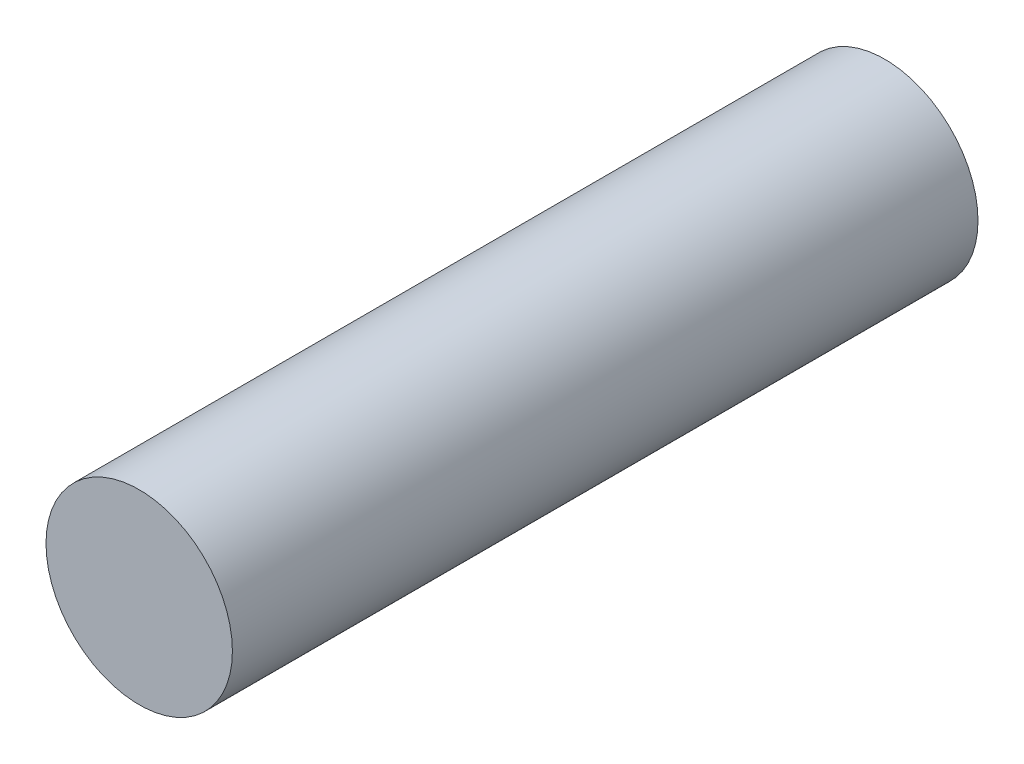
ISO-10303-21;
HEADER;
FILE_DESCRIPTION(('STEP AP214'),'2;1');
FILE_NAME('part.step','',(''),(''),'','','');
FILE_SCHEMA(('AUTOMOTIVE_DESIGN { 1 0 10303 214 1 1 1 1 }'));
ENDSEC;
DATA;
#1=APPLICATION_CONTEXT('core data for automotive mechanical design processes');
#2=APPLICATION_PROTOCOL_DEFINITION('international standard','automotive_design',2000,#1);
#3=PRODUCT_CONTEXT('',#1,'mechanical');
#4=PRODUCT('Part','Part','',(#3));
#5=PRODUCT_RELATED_PRODUCT_CATEGORY('part','',(#4));
#6=PRODUCT_DEFINITION_FORMATION('','',#4);
#7=PRODUCT_DEFINITION_CONTEXT('part definition',#1,'design');
#8=PRODUCT_DEFINITION('design','',#6,#7);
#9=PRODUCT_DEFINITION_SHAPE('','',#8);
#10=(LENGTH_UNIT() NAMED_UNIT(*) SI_UNIT(.MILLI.,.METRE.));
#11=(NAMED_UNIT(*) PLANE_ANGLE_UNIT() SI_UNIT($,.RADIAN.));
#12=(NAMED_UNIT(*) SI_UNIT($,.STERADIAN.) SOLID_ANGLE_UNIT());
#13=UNCERTAINTY_MEASURE_WITH_UNIT(LENGTH_MEASURE(1.E-05),#10,'distance_accuracy_value','');
#14=(GEOMETRIC_REPRESENTATION_CONTEXT(3) GLOBAL_UNCERTAINTY_ASSIGNED_CONTEXT((#13)) GLOBAL_UNIT_ASSIGNED_CONTEXT((#10,
#11,#12)) REPRESENTATION_CONTEXT('',''));
#15=CARTESIAN_POINT('',(0.,0.,0.));
#16=DIRECTION('',(0.,0.,1.));
#17=DIRECTION('',(1.,0.,0.));
#18=AXIS2_PLACEMENT_3D('',#15,#16,#17);
#19=CARTESIAN_POINT('',(0.,0.,76.2));
#20=DIRECTION('',(0.,0.,-1.));
#21=DIRECTION('',(-1.,0.,0.));
#22=AXIS2_PLACEMENT_3D('',#19,#20,#21);
#23=CYLINDRICAL_SURFACE('',#22,9.525);
#24=CARTESIAN_POINT('',(0.,0.,76.2));
#25=DIRECTION('',(0.,0.,1.));
#26=DIRECTION('',(1.,0.,0.));
#27=AXIS2_PLACEMENT_3D('',#24,#25,#26);
#28=CIRCLE('',#27,9.525);
#29=CARTESIAN_POINT('',(-9.525,0.,76.2));
#30=VERTEX_POINT('',#29);
#31=EDGE_CURVE('E10',#30,#30,#28,.T.);
#32=CARTESIAN_POINT('',(0.,0.,0.));
#33=DIRECTION('',(0.,0.,1.));
#34=DIRECTION('',(1.,0.,0.));
#35=AXIS2_PLACEMENT_3D('',#32,#33,#34);
#36=CIRCLE('',#35,9.525);
#37=CARTESIAN_POINT('',(-9.525,0.,0.));
#38=VERTEX_POINT('',#37);
#39=EDGE_CURVE('E40',#38,#38,#36,.T.);
#40=CARTESIAN_POINT('',(-9.525,0.,76.2));
#41=CARTESIAN_POINT('',(-9.525,0.,75.40625));
#42=CARTESIAN_POINT('',(-9.525,0.,74.6125));
#43=CARTESIAN_POINT('',(-9.525,0.,73.025));
#44=CARTESIAN_POINT('',(-9.525,0.,72.23125));
#45=CARTESIAN_POINT('',(-9.525,0.,70.64375));
#46=CARTESIAN_POINT('',(-9.525,0.,69.85));
#47=CARTESIAN_POINT('',(-9.525,0.,68.2625));
#48=CARTESIAN_POINT('',(-9.525,0.,67.46875));
#49=CARTESIAN_POINT('',(-9.525,0.,65.88125));
#50=CARTESIAN_POINT('',(-9.525,0.,65.0875));
#51=CARTESIAN_POINT('',(-9.525,0.,63.5));
#52=CARTESIAN_POINT('',(-9.525,0.,62.70625));
#53=CARTESIAN_POINT('',(-9.525,0.,61.11875));
#54=CARTESIAN_POINT('',(-9.525,0.,60.325));
#55=CARTESIAN_POINT('',(-9.525,0.,58.7375));
#56=CARTESIAN_POINT('',(-9.525,0.,57.94375));
#57=CARTESIAN_POINT('',(-9.525,0.,56.35625));
#58=CARTESIAN_POINT('',(-9.525,0.,55.5625));
#59=CARTESIAN_POINT('',(-9.525,0.,53.975));
#60=CARTESIAN_POINT('',(-9.525,0.,53.18125));
#61=CARTESIAN_POINT('',(-9.525,0.,51.59375));
#62=CARTESIAN_POINT('',(-9.525,0.,50.8));
#63=CARTESIAN_POINT('',(-9.525,0.,49.2125));
#64=CARTESIAN_POINT('',(-9.525,0.,48.41875));
#65=CARTESIAN_POINT('',(-9.525,0.,46.83125));
#66=CARTESIAN_POINT('',(-9.525,0.,46.0375));
#67=CARTESIAN_POINT('',(-9.525,0.,44.45));
#68=CARTESIAN_POINT('',(-9.525,0.,43.65625));
#69=CARTESIAN_POINT('',(-9.525,0.,42.06875));
#70=CARTESIAN_POINT('',(-9.525,0.,41.275));
#71=CARTESIAN_POINT('',(-9.525,0.,39.6875));
#72=CARTESIAN_POINT('',(-9.525,0.,38.89375));
#73=CARTESIAN_POINT('',(-9.525,0.,37.30625));
#74=CARTESIAN_POINT('',(-9.525,0.,36.5125));
#75=CARTESIAN_POINT('',(-9.525,0.,34.925));
#76=CARTESIAN_POINT('',(-9.525,0.,34.13125));
#77=CARTESIAN_POINT('',(-9.525,0.,32.54375));
#78=CARTESIAN_POINT('',(-9.525,0.,31.75));
#79=CARTESIAN_POINT('',(-9.525,0.,30.1625));
#80=CARTESIAN_POINT('',(-9.525,0.,29.36875));
#81=CARTESIAN_POINT('',(-9.525,0.,27.78125));
#82=CARTESIAN_POINT('',(-9.525,0.,26.9875));
#83=CARTESIAN_POINT('',(-9.525,0.,25.4));
#84=CARTESIAN_POINT('',(-9.525,0.,24.60625));
#85=CARTESIAN_POINT('',(-9.525,0.,23.01875));
#86=CARTESIAN_POINT('',(-9.525,0.,22.225));
#87=CARTESIAN_POINT('',(-9.525,0.,20.6375));
#88=CARTESIAN_POINT('',(-9.525,0.,19.84375));
#89=CARTESIAN_POINT('',(-9.525,0.,18.25625));
#90=CARTESIAN_POINT('',(-9.525,0.,17.4625));
#91=CARTESIAN_POINT('',(-9.525,0.,15.875));
#92=CARTESIAN_POINT('',(-9.525,0.,15.08125));
#93=CARTESIAN_POINT('',(-9.525,0.,13.49375));
#94=CARTESIAN_POINT('',(-9.525,0.,12.7));
#95=CARTESIAN_POINT('',(-9.525,0.,11.1125));
#96=CARTESIAN_POINT('',(-9.525,0.,10.31875));
#97=CARTESIAN_POINT('',(-9.525,0.,8.73125));
#98=CARTESIAN_POINT('',(-9.525,0.,7.93750000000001));
#99=CARTESIAN_POINT('',(-9.525,0.,6.35));
#100=CARTESIAN_POINT('',(-9.525,0.,5.55625));
#101=CARTESIAN_POINT('',(-9.525,0.,3.96875));
#102=CARTESIAN_POINT('',(-9.525,0.,3.175));
#103=CARTESIAN_POINT('',(-9.525,0.,1.5875));
#104=CARTESIAN_POINT('',(-9.525,0.,0.793750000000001));
#105=CARTESIAN_POINT('',(-9.525,0.,0.));
#106=B_SPLINE_CURVE_WITH_KNOTS('',3,(#40,#41,#42,#43,#44,#45,#46,#47,#48,#49,#50,#51,#52,#53,
#54,#55,#56,#57,#58,#59,#60,#61,#62,#63,#64,#65,#66,#67,#68,#69,#70,#71,#72,#73,#74,#75,#76,#77,
#78,#79,#80,#81,#82,#83,#84,#85,#86,#87,#88,#89,#90,#91,#92,#93,#94,#95,#96,#97,#98,#99,#100,
#101,#102,#103,#104,#105),.UNSPECIFIED.,.F.,.F.,(4,2,2,2,2,2,2,2,2,2,2,2,2,2,2,2,2,2,2,2,2,2,2,
2,2,2,2,2,2,2,2,2,4),(0.,2.38125,4.7625,7.14375,9.52500000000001,11.90625,14.2875,16.66875,
19.05,21.43125,23.8125,26.19375,28.575,30.95625,33.3375,35.71875,38.1,40.48125,42.8625,45.24375,
47.625,50.00625,52.3875,54.76875,57.15,59.53125,61.9125,64.29375,66.675,69.05625,71.4375,
73.81875,76.2),.UNSPECIFIED.);
#107=EDGE_CURVE('BSEAM37',#30,#38,#106,.T.);
#108=ORIENTED_EDGE('',*,*,#31,.F.);
#109=ORIENTED_EDGE('',*,*,#39,.T.);
#110=ORIENTED_EDGE('',*,*,#107,.T.);
#111=ORIENTED_EDGE('',*,*,#107,.F.);
#112=EDGE_LOOP('',(#108,#110,#109,#111));
#113=FACE_BOUND('',#112,.T.);
#114=ADVANCED_FACE('F37',(#113),#23,.T.);
#115=CARTESIAN_POINT('',(0.,0.,76.2));
#116=DIRECTION('',(0.,0.,1.));
#117=DIRECTION('',(1.,0.,0.));
#118=AXIS2_PLACEMENT_3D('',#115,#116,#117);
#119=PLANE('',#118);
#120=ORIENTED_EDGE('',*,*,#31,.T.);
#121=EDGE_LOOP('',(#120));
#122=FACE_BOUND('',#121,.T.);
#123=ADVANCED_FACE('F56',(#122),#119,.T.);
#124=CARTESIAN_POINT('',(0.,0.,0.));
#125=DIRECTION('',(0.,0.,1.));
#126=DIRECTION('',(1.,0.,0.));
#127=AXIS2_PLACEMENT_3D('',#124,#125,#126);
#128=PLANE('',#127);
#129=ORIENTED_EDGE('',*,*,#39,.F.);
#130=EDGE_LOOP('',(#129));
#131=FACE_BOUND('',#130,.T.);
#132=ADVANCED_FACE('F54',(#131),#128,.F.);
#133=CLOSED_SHELL('',(#114,#123,#132));
#134=MANIFOLD_SOLID_BREP('B2',#133);
#135=ADVANCED_BREP_SHAPE_REPRESENTATION('',(#18,#134),#14);
#136=SHAPE_DEFINITION_REPRESENTATION(#9,#135);
ENDSEC;
END-ISO-10303-21;
